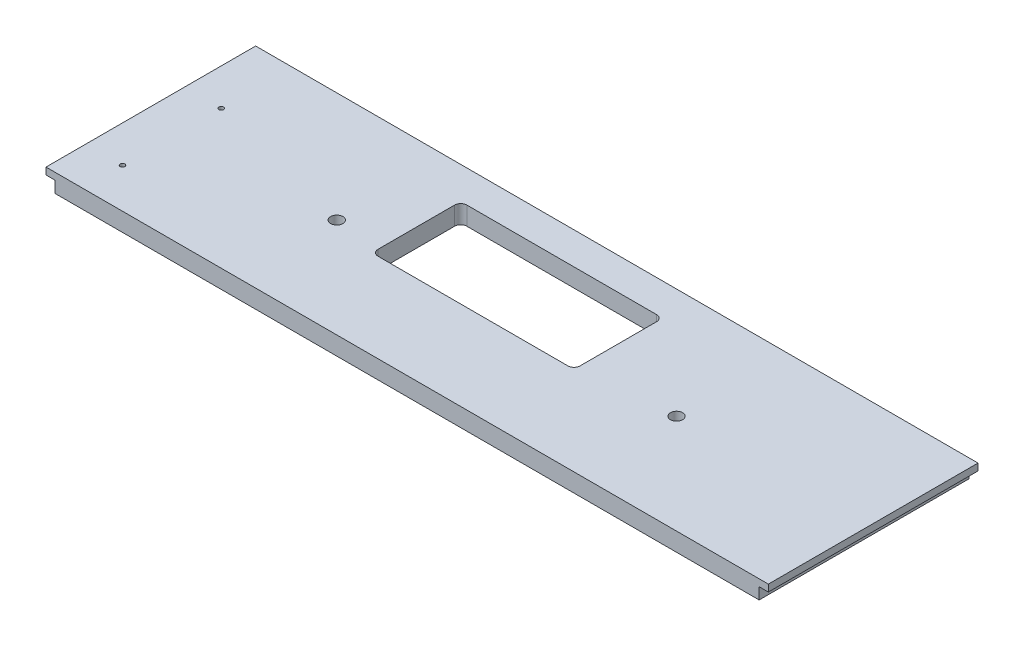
from build123d import *

# Parameters (mm, degrees)
SKETCH1_W           = 749.3
SKETCH1_H           = 217.4875
BOSS_EXTRUDE1_DEPTH = 19.05
CUT_EXTRUDE1_DEPTH  = 391.577429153
SKETCH3_W           = 9.525
SKETCH3_H           = 11.90625
CUT_EXTRUDE2_DEPTH  = 434.620038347
SKETCH5_R           = 6.35
CUT_EXTRUDE3_DEPTH  = 391.577429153
SKETCH6_R           = 2.413
CUT_EXTRUDE4_DEPTH  = 391.577429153
SKETCH7_R           = 0.396875
CUT_EXTRUDE5_DEPTH  = 6.35


with BuildPart() as part:
    # Sketch1 → Boss-Extrude1 (new body)
    with BuildSketch(Plane(origin=(0, 0, 0), x_dir=(1, 0, 0), z_dir=(0, 1, 0))):
        Rectangle(SKETCH1_W, SKETCH1_H)
    extrude(amount=BOSS_EXTRUDE1_DEPTH)

    # Sketch2 → Cut-Extrude1 (cut, through all)
    with BuildSketch(Plane(origin=(0, 19.05, 0), x_dir=(1, 0, 0), z_dir=(0, 1, 0))):
        with BuildLine():
            Line((-122.2375, 75.40625), (74.6125, 75.40625))
            ThreePointArc((74.6125, 75.40625), (79.102628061, 73.546378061), (80.9625, 69.05625))
            Line((80.9625, 69.05625), (80.9625, -10.31875))
            ThreePointArc((80.9625, -10.31875), (79.102628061, -14.808878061), (74.6125, -16.66875))
            Line((74.6125, -16.66875), (-122.2375, -16.66875))
            ThreePointArc((-122.2375, -16.66875), (-126.727628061, -14.808878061), (-128.5875, -10.31875))
            Line((-128.5875, -10.31875), (-128.5875, 69.05625))
            ThreePointArc((-128.5875, 69.05625), (-126.727628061, 73.546378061), (-122.2375, 75.40625))
        make_face()
    extrude(amount=-CUT_EXTRUDE1_DEPTH, mode=Mode.SUBTRACT)

    # Sketch3 → Cut-Extrude2 (cut, through all)
    with BuildSketch(Plane.XY.offset(108.74375)):
        with Locations((369.8875, 5.953125)):
            Rectangle(SKETCH3_W, SKETCH3_H)
        with Locations((-369.8875, 5.953125)):
            Rectangle(SKETCH3_W, SKETCH3_H)
    extrude(amount=-CUT_EXTRUDE2_DEPTH, mode=Mode.SUBTRACT)

    # Sketch5 → Cut-Extrude3 (cut, through all)
    with BuildSketch(Plane(origin=(0, 19.05, 0), x_dir=(1, 0, 0), z_dir=(0, 1, 0))):
        with Locations(Location((-176.2125, -5.55625, 0), (0, 0, 270))):
            Circle(SKETCH5_R)
        with Locations(Location((176.2125, -5.55625, 0), (0, 0, 270))):
            Circle(SKETCH5_R)
    extrude(amount=-CUT_EXTRUDE3_DEPTH, mode=Mode.SUBTRACT)

    # Sketch6 → Cut-Extrude4 (cut, through all)
    with BuildSketch(Plane.XZ):
        with Locations(Location((-336.55, -34.925, 0), (0, 0, 270))):
            Circle(SKETCH6_R)
        with Locations(Location((-336.55, 67.46875, 0), (0, 0, 270))):
            Circle(SKETCH6_R)
    extrude(amount=-CUT_EXTRUDE4_DEPTH, mode=Mode.SUBTRACT)

    # Sketch7 → Cut-Extrude5 (cut)
    with BuildSketch(Plane.XZ):
        with Locations(Location((-352.425, -96.04375, 0), (0, 0, 270))):
            Circle(SKETCH7_R)
        with Locations(Location((-352.425, 92.86875, 0), (0, 0, 270))):
            Circle(SKETCH7_R)
        with Locations(Location((352.425, 92.86875, 0), (0, 0, 270))):
            Circle(SKETCH7_R)
        with Locations(Location((352.425, -96.04375, 0), (0, 0, 270))):
            Circle(SKETCH7_R)
    extrude(amount=-CUT_EXTRUDE5_DEPTH, mode=Mode.SUBTRACT)


solid = part.part
